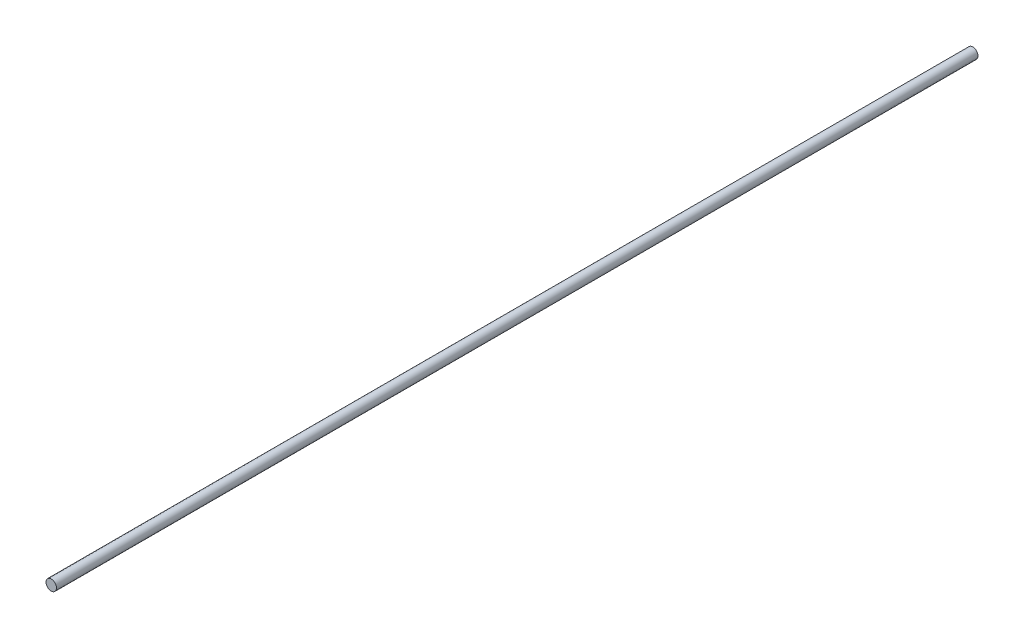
from build123d import *

# Parameters (mm, degrees)
CROQUIS1_R              = 2.5
SALIENTE_EXTRUIR1_DEPTH = 440


with BuildPart() as part:
    # Croquis1 → Saliente-Extruir1 (new body)
    with BuildSketch(Plane.XY):
        Circle(CROQUIS1_R)
    extrude(amount=SALIENTE_EXTRUIR1_DEPTH)


solid = part.part
